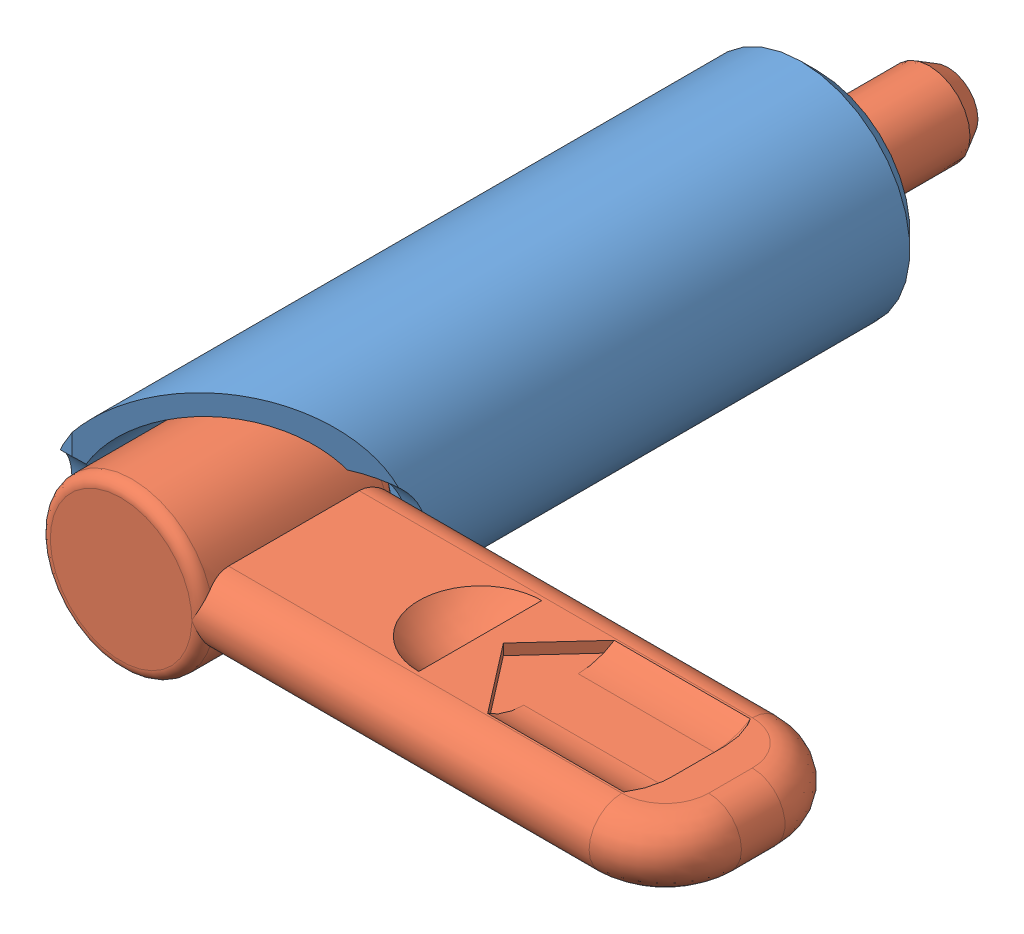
SolidWorks assembly GDX16L-6N-SUS.sldasm, configuration Default (file format 15000). Lengths in mm.
Overall size (48.01 16.01 61.21).
2 component instances, 2 part files, 0 mates.
Components (placement in the parent):
- GDX16L-6N-SUS_01-1: GDX16L-6N-SUS_01.SLDPRT [ﾃﾞﾌｫﾙﾄ] x (1 0 0) z (0 -1 0) size (16.02 50.53 16.01)
- GDX16L-6N-SUS_02-1: GDX16L-6N-SUS_02.SLDPRT [ﾃﾞﾌｫﾙﾄ] x (1 0 0) z (0 -1 0) size (46 61.21 12)
